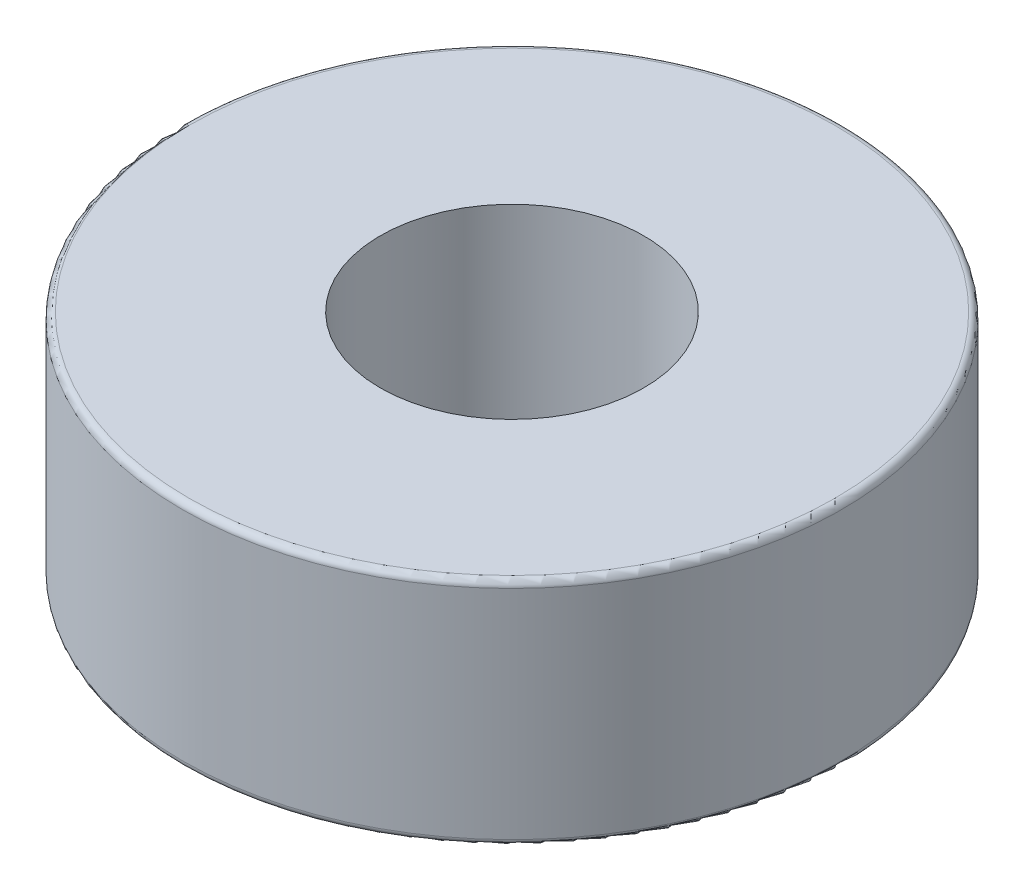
ISO-10303-21;
HEADER;
FILE_DESCRIPTION(('STEP AP214'),'2;1');
FILE_NAME('part.step','',(''),(''),'','','');
FILE_SCHEMA(('AUTOMOTIVE_DESIGN { 1 0 10303 214 1 1 1 1 }'));
ENDSEC;
DATA;
#1=APPLICATION_CONTEXT('core data for automotive mechanical design processes');
#2=APPLICATION_PROTOCOL_DEFINITION('international standard','automotive_design',2000,#1);
#3=PRODUCT_CONTEXT('',#1,'mechanical');
#4=PRODUCT('Part','Part','',(#3));
#5=PRODUCT_RELATED_PRODUCT_CATEGORY('part','',(#4));
#6=PRODUCT_DEFINITION_FORMATION('','',#4);
#7=PRODUCT_DEFINITION_CONTEXT('part definition',#1,'design');
#8=PRODUCT_DEFINITION('design','',#6,#7);
#9=PRODUCT_DEFINITION_SHAPE('','',#8);
#10=(LENGTH_UNIT() NAMED_UNIT(*) SI_UNIT(.MILLI.,.METRE.));
#11=(NAMED_UNIT(*) PLANE_ANGLE_UNIT() SI_UNIT($,.RADIAN.));
#12=(NAMED_UNIT(*) SI_UNIT($,.STERADIAN.) SOLID_ANGLE_UNIT());
#13=UNCERTAINTY_MEASURE_WITH_UNIT(LENGTH_MEASURE(1.E-05),#10,'distance_accuracy_value','');
#14=(GEOMETRIC_REPRESENTATION_CONTEXT(3) GLOBAL_UNCERTAINTY_ASSIGNED_CONTEXT((#13)) GLOBAL_UNIT_ASSIGNED_CONTEXT((#10,
#11,#12)) REPRESENTATION_CONTEXT('',''));
#15=CARTESIAN_POINT('',(0.,0.,0.));
#16=DIRECTION('',(0.,0.,1.));
#17=DIRECTION('',(1.,0.,0.));
#18=AXIS2_PLACEMENT_3D('',#15,#16,#17);
#19=CARTESIAN_POINT('',(0.,7.,0.));
#20=DIRECTION('',(0.,1.,0.));
#21=DIRECTION('',(0.,0.,1.));
#22=AXIS2_PLACEMENT_3D('',#19,#20,#21);
#23=PLANE('',#22);
#24=CARTESIAN_POINT('',(0.,7.,0.));
#25=DIRECTION('',(0.,1.,0.));
#26=DIRECTION('',(0.,0.,1.));
#27=AXIS2_PLACEMENT_3D('',#24,#25,#26);
#28=CIRCLE('',#27,9.8);
#29=CARTESIAN_POINT('',(0.,7.,9.8));
#30=VERTEX_POINT('',#29);
#31=EDGE_CURVE('E10',#30,#30,#28,.T.);
#32=ORIENTED_EDGE('',*,*,#31,.T.);
#33=EDGE_LOOP('',(#32));
#34=FACE_BOUND('',#33,.T.);
#35=CARTESIAN_POINT('',(0.,7.,0.));
#36=DIRECTION('',(0.,1.,0.));
#37=DIRECTION('',(0.,0.,1.));
#38=AXIS2_PLACEMENT_3D('',#35,#36,#37);
#39=CIRCLE('',#38,4.);
#40=CARTESIAN_POINT('',(0.,7.,4.));
#41=VERTEX_POINT('',#40);
#42=EDGE_CURVE('E51',#41,#41,#39,.T.);
#43=ORIENTED_EDGE('',*,*,#42,.F.);
#44=EDGE_LOOP('',(#43));
#45=FACE_BOUND('',#44,.T.);
#46=ADVANCED_FACE('F31',(#34,#45),#23,.T.);
#47=CARTESIAN_POINT('',(0.,0.,0.));
#48=DIRECTION('',(0.,1.,0.));
#49=DIRECTION('',(0.,0.,1.));
#50=AXIS2_PLACEMENT_3D('',#47,#48,#49);
#51=PLANE('',#50);
#52=CARTESIAN_POINT('',(0.,0.,0.));
#53=DIRECTION('',(0.,1.,0.));
#54=DIRECTION('',(0.,0.,1.));
#55=AXIS2_PLACEMENT_3D('',#52,#53,#54);
#56=CIRCLE('',#55,9.8);
#57=CARTESIAN_POINT('',(0.,0.,9.8));
#58=VERTEX_POINT('',#57);
#59=EDGE_CURVE('E38',#58,#58,#56,.F.);
#60=ORIENTED_EDGE('',*,*,#59,.T.);
#61=EDGE_LOOP('',(#60));
#62=FACE_BOUND('',#61,.T.);
#63=CARTESIAN_POINT('',(0.,0.,0.));
#64=DIRECTION('',(0.,1.,0.));
#65=DIRECTION('',(0.,0.,1.));
#66=AXIS2_PLACEMENT_3D('',#63,#64,#65);
#67=CIRCLE('',#66,4.);
#68=CARTESIAN_POINT('',(0.,0.,4.));
#69=VERTEX_POINT('',#68);
#70=EDGE_CURVE('E52',#69,#69,#67,.T.);
#71=ORIENTED_EDGE('',*,*,#70,.T.);
#72=EDGE_LOOP('',(#71));
#73=FACE_BOUND('',#72,.T.);
#74=ADVANCED_FACE('F62',(#62,#73),#51,.F.);
#75=CARTESIAN_POINT('',(0.,7.,0.));
#76=DIRECTION('',(0.,-1.,0.));
#77=DIRECTION('',(0.,0.,-1.));
#78=AXIS2_PLACEMENT_3D('',#75,#76,#77);
#79=CYLINDRICAL_SURFACE('',#78,10.);
#80=CARTESIAN_POINT('',(0.,0.2,0.));
#81=DIRECTION('',(0.,1.,0.));
#82=DIRECTION('',(0.,0.,1.));
#83=AXIS2_PLACEMENT_3D('',#80,#81,#82);
#84=CIRCLE('',#83,10.);
#85=CARTESIAN_POINT('',(0.,0.2,10.));
#86=VERTEX_POINT('',#85);
#87=EDGE_CURVE('E42',#86,#86,#84,.T.);
#88=ORIENTED_EDGE('',*,*,#87,.T.);
#89=EDGE_LOOP('',(#88));
#90=FACE_BOUND('',#89,.T.);
#91=CARTESIAN_POINT('',(0.,6.8,0.));
#92=DIRECTION('',(0.,1.,0.));
#93=DIRECTION('',(0.,0.,1.));
#94=AXIS2_PLACEMENT_3D('',#91,#92,#93);
#95=CIRCLE('',#94,10.);
#96=CARTESIAN_POINT('',(0.,6.8,10.));
#97=VERTEX_POINT('',#96);
#98=EDGE_CURVE('E46',#97,#97,#95,.F.);
#99=ORIENTED_EDGE('',*,*,#98,.T.);
#100=EDGE_LOOP('',(#99));
#101=FACE_BOUND('',#100,.T.);
#102=ADVANCED_FACE('F67',(#90,#101),#79,.T.);
#103=CARTESIAN_POINT('',(0.,7.,0.));
#104=DIRECTION('',(0.,-1.,0.));
#105=DIRECTION('',(0.,0.,-1.));
#106=AXIS2_PLACEMENT_3D('',#103,#104,#105);
#107=CYLINDRICAL_SURFACE('',#106,4.);
#108=ORIENTED_EDGE('',*,*,#42,.T.);
#109=EDGE_LOOP('',(#108));
#110=FACE_BOUND('',#109,.T.);
#111=ORIENTED_EDGE('',*,*,#70,.F.);
#112=EDGE_LOOP('',(#111));
#113=FACE_BOUND('',#112,.T.);
#114=ADVANCED_FACE('F58',(#110,#113),#107,.F.);
#115=CARTESIAN_POINT('',(0.,0.2,0.));
#116=DIRECTION('',(0.,1.,0.));
#117=DIRECTION('',(0.,0.,1.));
#118=AXIS2_PLACEMENT_3D('',#115,#116,#117);
#119=TOROIDAL_SURFACE('',#118,9.8,0.2);
#120=ORIENTED_EDGE('',*,*,#59,.F.);
#121=EDGE_LOOP('',(#120));
#122=FACE_BOUND('',#121,.T.);
#123=ORIENTED_EDGE('',*,*,#87,.F.);
#124=EDGE_LOOP('',(#123));
#125=FACE_BOUND('',#124,.T.);
#126=ADVANCED_FACE('F73',(#122,#125),#119,.T.);
#127=CARTESIAN_POINT('',(0.,6.8,0.));
#128=DIRECTION('',(0.,1.,0.));
#129=DIRECTION('',(0.,0.,1.));
#130=AXIS2_PLACEMENT_3D('',#127,#128,#129);
#131=TOROIDAL_SURFACE('',#130,9.8,0.2);
#132=ORIENTED_EDGE('',*,*,#98,.F.);
#133=EDGE_LOOP('',(#132));
#134=FACE_BOUND('',#133,.T.);
#135=ORIENTED_EDGE('',*,*,#31,.F.);
#136=EDGE_LOOP('',(#135));
#137=FACE_BOUND('',#136,.T.);
#138=ADVANCED_FACE('F33',(#134,#137),#131,.T.);
#139=CLOSED_SHELL('',(#46,#74,#102,#114,#126,#138));
#140=MANIFOLD_SOLID_BREP('B2',#139);
#141=ADVANCED_BREP_SHAPE_REPRESENTATION('',(#18,#140),#14);
#142=SHAPE_DEFINITION_REPRESENTATION(#9,#141);
ENDSEC;
END-ISO-10303-21;
